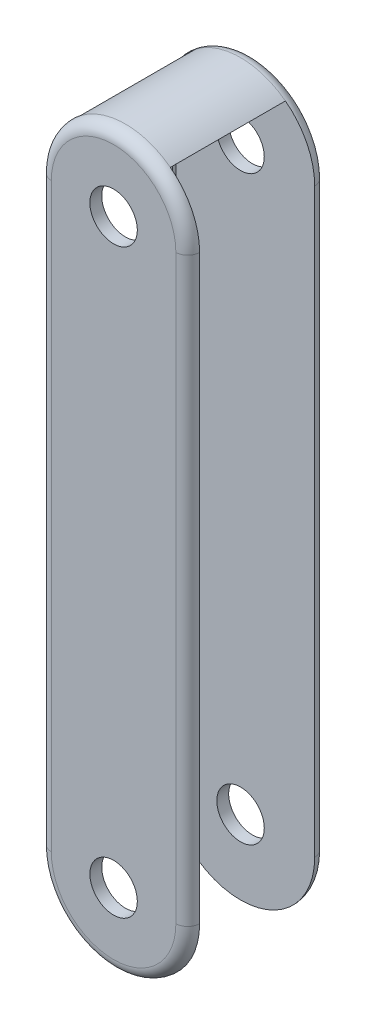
from build123d import *

# Parameters (mm, degrees)
BASE_EXTRUSION_DEPTH    = 11.7
CONG_1_R                = 1
CONG_2_R                = 1
ESQUISSE2_W             = 9.7
ESQUISSE2_H             = 65.100918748
ENL_V_MAT_EXTRU_1_DEPTH = 11.7
ESQUISSE3_W             = 9.7
ESQUISSE3_H             = 9.8
ENL_V_MAT_EXTRU_3_DEPTH = 11.7
ESQUISSE4_R             = 2
ENL_V_MAT_EXTRU_4_DEPTH = 58.842047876


with BuildPart() as part:
    # Esquisse1 → Base-Extrusion (new body)
    with BuildSketch(Plane.XY):
        with BuildLine():
            Line((0, 0), (0, 49))
            ThreePointArc((0, 49), (6.25, 55.25), (12.5, 49))
            Line((12.5, 49), (12.5, 0))
            ThreePointArc((12.5, 0), (6.25, -6.25), (0, 0))
        make_face()
    extrude(amount=BASE_EXTRUSION_DEPTH)

    # Cong_1
    cong_1_edges = [part.edges().sort_by_distance(p)[0] for p in [
        (6.25, 55.25, 11.7),
        (0, 24.5, 11.7),
        (6.25, -6.25, 11.7),
        (12.5, 24.5, 11.7),
    ]]
    fillet(cong_1_edges, radius=CONG_1_R)

    # Cong_2
    cong_2_edges = [part.edges().sort_by_distance(p)[0] for p in [
        (0, 24.5, 0),
        (6.25, 55.25, 0),
        (12.5, 24.5, 0),
        (6.25, -6.25, 0),
    ]]
    fillet(cong_2_edges, radius=CONG_2_R)

    # Esquisse2 → Enl_v. mat.-Extru.1 (cut)
    with BuildSketch(Plane(origin=(12.5, 0, 0), x_dir=(0, 0, -1), z_dir=(1, 0, 0))):
        with Locations((-5.85, 21.424016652)):
            Rectangle(ESQUISSE2_W, ESQUISSE2_H)
    extrude(amount=-ENL_V_MAT_EXTRU_1_DEPTH, mode=Mode.SUBTRACT)

    # Esquisse3 → Enl_v. mat.-Extru.3 (cut)
    with BuildSketch(Plane.ZY):
        with BuildLine():
            Line((1.3, 49.948011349), (1.3, 15.15))
            ThreePointArc((1.3, 15.15), (5.3, 11.15), (9.3, 15.15))
            Line((9.3, 15.15), (9.3, 49.948011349))
            Line((9.3, 49.948011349), (1.3, 49.948011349))
        make_face()
        with Locations((5.85, -1.35)):
            Rectangle(ESQUISSE3_W, ESQUISSE3_H)
    extrude(amount=-ENL_V_MAT_EXTRU_3_DEPTH, mode=Mode.SUBTRACT)

    # Esquisse4 → Enl_v. mat.-Extru.4 (cut, through all)
    with BuildSketch(Plane.XY.offset(11.7)):
        with Locations((6.25, 0)):
            Circle(ESQUISSE4_R)
        with Locations((6.25, 49)):
            Circle(ESQUISSE4_R)
    extrude(amount=-ENL_V_MAT_EXTRU_4_DEPTH, mode=Mode.SUBTRACT)


solid = part.part
